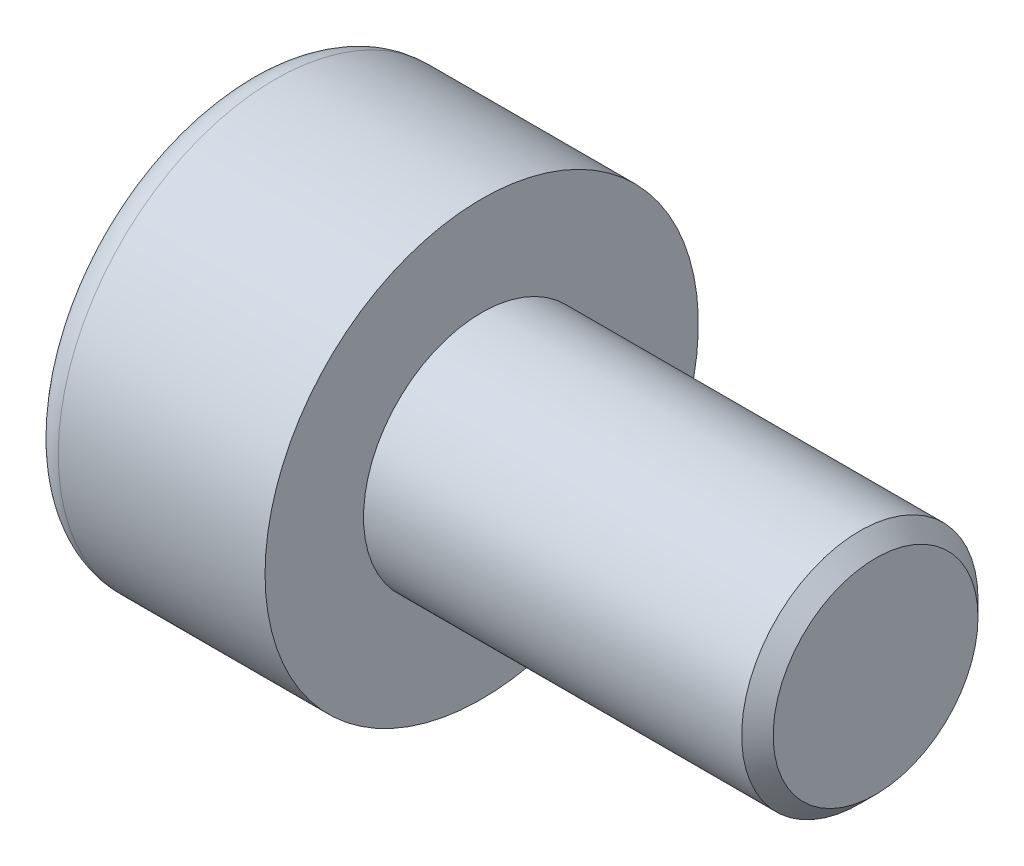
ISO-10303-21;
HEADER;
FILE_DESCRIPTION(('STEP AP214'),'2;1');
FILE_NAME('part.step','',(''),(''),'','','');
FILE_SCHEMA(('AUTOMOTIVE_DESIGN { 1 0 10303 214 1 1 1 1 }'));
ENDSEC;
DATA;
#1=APPLICATION_CONTEXT('core data for automotive mechanical design processes');
#2=APPLICATION_PROTOCOL_DEFINITION('international standard','automotive_design',2000,#1);
#3=PRODUCT_CONTEXT('',#1,'mechanical');
#4=PRODUCT('Part','Part','',(#3));
#5=PRODUCT_RELATED_PRODUCT_CATEGORY('part','',(#4));
#6=PRODUCT_DEFINITION_FORMATION('','',#4);
#7=PRODUCT_DEFINITION_CONTEXT('part definition',#1,'design');
#8=PRODUCT_DEFINITION('design','',#6,#7);
#9=PRODUCT_DEFINITION_SHAPE('','',#8);
#10=(LENGTH_UNIT() NAMED_UNIT(*) SI_UNIT(.MILLI.,.METRE.));
#11=(NAMED_UNIT(*) PLANE_ANGLE_UNIT() SI_UNIT($,.RADIAN.));
#12=(NAMED_UNIT(*) SI_UNIT($,.STERADIAN.) SOLID_ANGLE_UNIT());
#13=UNCERTAINTY_MEASURE_WITH_UNIT(LENGTH_MEASURE(1.E-05),#10,'distance_accuracy_value','');
#14=(GEOMETRIC_REPRESENTATION_CONTEXT(3) GLOBAL_UNCERTAINTY_ASSIGNED_CONTEXT((#13)) GLOBAL_UNIT_ASSIGNED_CONTEXT((#10,
#11,#12)) REPRESENTATION_CONTEXT('',''));
#15=CARTESIAN_POINT('',(0.,0.,0.));
#16=DIRECTION('',(0.,0.,1.));
#17=DIRECTION('',(1.,0.,0.));
#18=AXIS2_PLACEMENT_3D('',#15,#16,#17);
#19=CARTESIAN_POINT('',(1.30000000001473,0.,0.));
#20=DIRECTION('',(-1.,0.,0.));
#21=DIRECTION('',(0.,0.,1.));
#22=AXIS2_PLACEMENT_3D('',#19,#20,#21);
#23=CONICAL_SURFACE('',#22,1.24999999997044,1.04719755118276);
#24=CARTESIAN_POINT('',(2.02168783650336,0.,-5.6843418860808E-11));
#25=VERTEX_POINT('',#24);
#26=VERTEX_LOOP('',#25);
#27=FACE_BOUND('',#26,.T.);
#28=CARTESIAN_POINT('',(1.30000000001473,0.,0.));
#29=DIRECTION('',(-1.,0.,0.));
#30=DIRECTION('',(0.,0.,1.));
#31=AXIS2_PLACEMENT_3D('',#28,#29,#30);
#32=CIRCLE('',#31,1.24999999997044);
#33=CARTESIAN_POINT('',(1.30000000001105,1.24999999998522,0.));
#34=VERTEX_POINT('',#33);
#35=CARTESIAN_POINT('',(1.30000000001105,0.624999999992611,-1.08253175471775));
#36=VERTEX_POINT('',#35);
#37=EDGE_CURVE('E102',#34,#36,#32,.T.);
#38=ORIENTED_EDGE('',*,*,#37,.T.);
#39=CARTESIAN_POINT('',(1.30000000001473,0.,0.));
#40=DIRECTION('',(-1.,0.,0.));
#41=DIRECTION('',(0.,0.,1.));
#42=AXIS2_PLACEMENT_3D('',#39,#40,#41);
#43=CIRCLE('',#42,1.24999999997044);
#44=CARTESIAN_POINT('',(1.30000000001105,-0.62499999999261,-1.08253175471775));
#45=VERTEX_POINT('',#44);
#46=EDGE_CURVE('E105',#36,#45,#43,.T.);
#47=ORIENTED_EDGE('',*,*,#46,.T.);
#48=CARTESIAN_POINT('',(1.30000000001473,0.,0.));
#49=DIRECTION('',(-1.,0.,0.));
#50=DIRECTION('',(0.,0.,1.));
#51=AXIS2_PLACEMENT_3D('',#48,#49,#50);
#52=CIRCLE('',#51,1.24999999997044);
#53=CARTESIAN_POINT('',(1.30000000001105,-1.24999999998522,0.));
#54=VERTEX_POINT('',#53);
#55=EDGE_CURVE('E79',#45,#54,#52,.T.);
#56=ORIENTED_EDGE('',*,*,#55,.T.);
#57=CARTESIAN_POINT('',(1.30000000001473,0.,0.));
#58=DIRECTION('',(-1.,0.,0.));
#59=DIRECTION('',(0.,0.,1.));
#60=AXIS2_PLACEMENT_3D('',#57,#58,#59);
#61=CIRCLE('',#60,1.24999999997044);
#62=CARTESIAN_POINT('',(1.30000000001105,-0.624999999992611,1.08253175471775));
#63=VERTEX_POINT('',#62);
#64=EDGE_CURVE('E306',#54,#63,#61,.T.);
#65=ORIENTED_EDGE('',*,*,#64,.T.);
#66=CARTESIAN_POINT('',(1.30000000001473,0.,0.));
#67=DIRECTION('',(-1.,0.,0.));
#68=DIRECTION('',(0.,0.,1.));
#69=AXIS2_PLACEMENT_3D('',#66,#67,#68);
#70=CIRCLE('',#69,1.24999999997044);
#71=CARTESIAN_POINT('',(1.30000000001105,0.62499999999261,1.08253175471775));
#72=VERTEX_POINT('',#71);
#73=EDGE_CURVE('E308',#63,#72,#70,.T.);
#74=ORIENTED_EDGE('',*,*,#73,.T.);
#75=CARTESIAN_POINT('',(1.30000000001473,0.,0.));
#76=DIRECTION('',(-1.,0.,0.));
#77=DIRECTION('',(0.,0.,1.));
#78=AXIS2_PLACEMENT_3D('',#75,#76,#77);
#79=CIRCLE('',#78,1.24999999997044);
#80=EDGE_CURVE('E108',#72,#34,#79,.T.);
#81=ORIENTED_EDGE('',*,*,#80,.T.);
#82=EDGE_LOOP('',(#38,#47,#56,#65,#74,#81));
#83=FACE_BOUND('',#82,.T.);
#84=ADVANCED_FACE('F36',(#27,#83),#23,.F.);
#85=CARTESIAN_POINT('',(1.3,0.,-1.44337567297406));
#86=DIRECTION('',(1.,0.,0.));
#87=DIRECTION('',(0.,0.,-1.));
#88=AXIS2_PLACEMENT_3D('',#85,#86,#87);
#89=PLANE('',#88);
#90=DIRECTION('',(0.,0.,1.));
#91=VECTOR('',#90,1.);
#92=CARTESIAN_POINT('',(1.30000000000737,-1.25,0.721687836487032));
#93=LINE('',#92,#91);
#94=CARTESIAN_POINT('',(1.30000000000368,-1.24999999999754,-0.721687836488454));
#95=VERTEX_POINT('',#94);
#96=EDGE_CURVE('E208',#54,#95,#93,.F.);
#97=ORIENTED_EDGE('',*,*,#96,.F.);
#98=ORIENTED_EDGE('',*,*,#55,.F.);
#99=DIRECTION('',(0.,-0.866025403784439,0.5));
#100=VECTOR('',#99,1.);
#101=CARTESIAN_POINT('',(1.3,-1.25,-0.721687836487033));
#102=LINE('',#101,#100);
#103=EDGE_CURVE('E85',#95,#45,#102,.F.);
#104=ORIENTED_EDGE('',*,*,#103,.F.);
#105=EDGE_LOOP('',(#97,#98,#104));
#106=FACE_BOUND('',#105,.T.);
#107=ADVANCED_FACE('F97',(#106),#89,.F.);
#108=CARTESIAN_POINT('',(1.3,0.,-1.44337567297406));
#109=DIRECTION('',(1.,0.,0.));
#110=DIRECTION('',(0.,0.,-1.));
#111=AXIS2_PLACEMENT_3D('',#108,#109,#110);
#112=PLANE('',#111);
#113=DIRECTION('',(0.,0.866025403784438,0.5));
#114=VECTOR('',#113,1.);
#115=CARTESIAN_POINT('',(1.30000000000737,0.,1.44337567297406));
#116=LINE('',#115,#114);
#117=CARTESIAN_POINT('',(1.30000000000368,-1.25,0.721687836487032));
#118=VERTEX_POINT('',#117);
#119=EDGE_CURVE('E193',#63,#118,#116,.F.);
#120=ORIENTED_EDGE('',*,*,#119,.F.);
#121=ORIENTED_EDGE('',*,*,#64,.F.);
#122=DIRECTION('',(0.,0.,1.));
#123=VECTOR('',#122,1.);
#124=CARTESIAN_POINT('',(1.3,-1.25,0.721687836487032));
#125=LINE('',#124,#123);
#126=EDGE_CURVE('E196',#118,#54,#125,.F.);
#127=ORIENTED_EDGE('',*,*,#126,.F.);
#128=EDGE_LOOP('',(#120,#121,#127));
#129=FACE_BOUND('',#128,.T.);
#130=ADVANCED_FACE('F296',(#129),#112,.F.);
#131=CARTESIAN_POINT('',(1.3,0.,-1.44337567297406));
#132=DIRECTION('',(1.,0.,0.));
#133=DIRECTION('',(0.,0.,-1.));
#134=AXIS2_PLACEMENT_3D('',#131,#132,#133);
#135=PLANE('',#134);
#136=DIRECTION('',(0.,0.866025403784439,-0.5));
#137=VECTOR('',#136,1.);
#138=CARTESIAN_POINT('',(1.30000000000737,1.25,0.721687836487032));
#139=LINE('',#138,#137);
#140=CARTESIAN_POINT('',(1.30000000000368,0.,1.44337567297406));
#141=VERTEX_POINT('',#140);
#142=EDGE_CURVE('E178',#72,#141,#139,.F.);
#143=ORIENTED_EDGE('',*,*,#142,.F.);
#144=ORIENTED_EDGE('',*,*,#73,.F.);
#145=DIRECTION('',(0.,0.866025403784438,0.5));
#146=VECTOR('',#145,1.);
#147=CARTESIAN_POINT('',(1.3,0.,1.44337567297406));
#148=LINE('',#147,#146);
#149=EDGE_CURVE('E181',#141,#63,#148,.F.);
#150=ORIENTED_EDGE('',*,*,#149,.F.);
#151=EDGE_LOOP('',(#143,#144,#150));
#152=FACE_BOUND('',#151,.T.);
#153=ADVANCED_FACE('F292',(#152),#135,.F.);
#154=CARTESIAN_POINT('',(1.3,0.,-1.44337567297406));
#155=DIRECTION('',(1.,0.,0.));
#156=DIRECTION('',(0.,0.,-1.));
#157=AXIS2_PLACEMENT_3D('',#154,#155,#156);
#158=PLANE('',#157);
#159=DIRECTION('',(0.,0.,-1.));
#160=VECTOR('',#159,1.);
#161=CARTESIAN_POINT('',(1.30000000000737,1.25,-0.721687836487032));
#162=LINE('',#161,#160);
#163=CARTESIAN_POINT('',(1.30000000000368,1.24999999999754,0.721687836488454));
#164=VERTEX_POINT('',#163);
#165=EDGE_CURVE('E163',#34,#164,#162,.F.);
#166=ORIENTED_EDGE('',*,*,#165,.F.);
#167=ORIENTED_EDGE('',*,*,#80,.F.);
#168=DIRECTION('',(0.,0.866025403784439,-0.5));
#169=VECTOR('',#168,1.);
#170=CARTESIAN_POINT('',(1.3,1.25,0.721687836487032));
#171=LINE('',#170,#169);
#172=EDGE_CURVE('E166',#164,#72,#171,.F.);
#173=ORIENTED_EDGE('',*,*,#172,.F.);
#174=EDGE_LOOP('',(#166,#167,#173));
#175=FACE_BOUND('',#174,.T.);
#176=ADVANCED_FACE('F289',(#175),#158,.F.);
#177=CARTESIAN_POINT('',(1.3,0.,-1.44337567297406));
#178=DIRECTION('',(1.,0.,0.));
#179=DIRECTION('',(0.,0.,-1.));
#180=AXIS2_PLACEMENT_3D('',#177,#178,#179);
#181=PLANE('',#180);
#182=DIRECTION('',(0.,-0.866025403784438,-0.5));
#183=VECTOR('',#182,1.);
#184=CARTESIAN_POINT('',(1.30000000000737,0.,-1.44337567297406));
#185=LINE('',#184,#183);
#186=CARTESIAN_POINT('',(1.30000000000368,1.25,-0.721687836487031));
#187=VERTEX_POINT('',#186);
#188=EDGE_CURVE('E115',#36,#187,#185,.F.);
#189=ORIENTED_EDGE('',*,*,#188,.F.);
#190=ORIENTED_EDGE('',*,*,#37,.F.);
#191=DIRECTION('',(0.,0.,-1.));
#192=VECTOR('',#191,1.);
#193=CARTESIAN_POINT('',(1.3,1.25,-0.721687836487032));
#194=LINE('',#193,#192);
#195=EDGE_CURVE('E118',#187,#34,#194,.F.);
#196=ORIENTED_EDGE('',*,*,#195,.F.);
#197=EDGE_LOOP('',(#189,#190,#196));
#198=FACE_BOUND('',#197,.T.);
#199=ADVANCED_FACE('F117',(#198),#181,.F.);
#200=CARTESIAN_POINT('',(1.3,0.,-1.44337567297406));
#201=DIRECTION('',(1.,0.,0.));
#202=DIRECTION('',(0.,0.,-1.));
#203=AXIS2_PLACEMENT_3D('',#200,#201,#202);
#204=PLANE('',#203);
#205=DIRECTION('',(0.,-0.866025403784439,0.5));
#206=VECTOR('',#205,1.);
#207=CARTESIAN_POINT('',(1.30000000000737,-1.25,-0.721687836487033));
#208=LINE('',#207,#206);
#209=CARTESIAN_POINT('',(1.30000000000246,0.,-1.44337567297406));
#210=VERTEX_POINT('',#209);
#211=EDGE_CURVE('E145',#45,#210,#208,.F.);
#212=ORIENTED_EDGE('',*,*,#211,.F.);
#213=ORIENTED_EDGE('',*,*,#46,.F.);
#214=DIRECTION('',(0.,-0.866025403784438,-0.5));
#215=VECTOR('',#214,1.);
#216=CARTESIAN_POINT('',(1.3,0.,-1.44337567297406));
#217=LINE('',#216,#215);
#218=EDGE_CURVE('E126',#210,#36,#217,.F.);
#219=ORIENTED_EDGE('',*,*,#218,.F.);
#220=EDGE_LOOP('',(#212,#213,#219));
#221=FACE_BOUND('',#220,.T.);
#222=ADVANCED_FACE('F283',(#221),#204,.F.);
#223=CARTESIAN_POINT('',(1.3,-1.25,-0.721687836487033));
#224=DIRECTION('',(0.,0.5,0.866025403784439));
#225=DIRECTION('',(0.,-0.866025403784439,0.5));
#226=AXIS2_PLACEMENT_3D('',#223,#224,#225);
#227=PLANE('',#226);
#228=DIRECTION('',(1.,0.,0.));
#229=VECTOR('',#228,1.);
#230=CARTESIAN_POINT('',(1.3,-1.25,-0.721687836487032));
#231=LINE('',#230,#229);
#232=CARTESIAN_POINT('',(0.,-1.25,-0.721687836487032));
#233=VERTEX_POINT('',#232);
#234=EDGE_CURVE('E205',#95,#233,#231,.F.);
#235=ORIENTED_EDGE('',*,*,#234,.F.);
#236=ORIENTED_EDGE('',*,*,#103,.T.);
#237=ORIENTED_EDGE('',*,*,#211,.T.);
#238=DIRECTION('',(1.,0.,0.));
#239=VECTOR('',#238,1.);
#240=CARTESIAN_POINT('',(1.3,0.,-1.44337567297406));
#241=LINE('',#240,#239);
#242=CARTESIAN_POINT('',(0.,0.,-1.44337567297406));
#243=VERTEX_POINT('',#242);
#244=EDGE_CURVE('E130',#243,#210,#241,.T.);
#245=ORIENTED_EDGE('',*,*,#244,.F.);
#246=DIRECTION('',(0.,-0.866025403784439,0.5));
#247=VECTOR('',#246,1.);
#248=CARTESIAN_POINT('',(0.,0.,-1.44337567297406));
#249=LINE('',#248,#247);
#250=EDGE_CURVE('E132',#243,#233,#249,.T.);
#251=ORIENTED_EDGE('',*,*,#250,.T.);
#252=EDGE_LOOP('',(#235,#236,#237,#245,#251));
#253=FACE_BOUND('',#252,.T.);
#254=ADVANCED_FACE('F279',(#253),#227,.T.);
#255=CARTESIAN_POINT('',(1.3,-1.25,0.721687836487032));
#256=DIRECTION('',(0.,1.,0.));
#257=DIRECTION('',(0.,0.,1.));
#258=AXIS2_PLACEMENT_3D('',#255,#256,#257);
#259=PLANE('',#258);
#260=DIRECTION('',(1.,0.,0.));
#261=VECTOR('',#260,1.);
#262=CARTESIAN_POINT('',(1.3,-1.25,0.721687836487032));
#263=LINE('',#262,#261);
#264=CARTESIAN_POINT('',(0.,-1.25,0.721687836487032));
#265=VERTEX_POINT('',#264);
#266=EDGE_CURVE('E190',#118,#265,#263,.F.);
#267=ORIENTED_EDGE('',*,*,#266,.F.);
#268=ORIENTED_EDGE('',*,*,#126,.T.);
#269=ORIENTED_EDGE('',*,*,#96,.T.);
#270=ORIENTED_EDGE('',*,*,#234,.T.);
#271=DIRECTION('',(0.,0.,-1.));
#272=VECTOR('',#271,1.);
#273=CARTESIAN_POINT('',(0.,-1.25,0.));
#274=LINE('',#273,#272);
#275=EDGE_CURVE('E135',#233,#265,#274,.F.);
#276=ORIENTED_EDGE('',*,*,#275,.T.);
#277=EDGE_LOOP('',(#267,#268,#269,#270,#276));
#278=FACE_BOUND('',#277,.T.);
#279=ADVANCED_FACE('F275',(#278),#259,.T.);
#280=CARTESIAN_POINT('',(1.3,0.,1.44337567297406));
#281=DIRECTION('',(0.,0.5,-0.866025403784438));
#282=DIRECTION('',(0.,0.866025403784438,0.5));
#283=AXIS2_PLACEMENT_3D('',#280,#281,#282);
#284=PLANE('',#283);
#285=DIRECTION('',(1.,0.,0.));
#286=VECTOR('',#285,1.);
#287=CARTESIAN_POINT('',(1.3,0.,1.44337567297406));
#288=LINE('',#287,#286);
#289=CARTESIAN_POINT('',(0.,0.,1.44337567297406));
#290=VERTEX_POINT('',#289);
#291=EDGE_CURVE('E175',#141,#290,#288,.F.);
#292=ORIENTED_EDGE('',*,*,#291,.F.);
#293=ORIENTED_EDGE('',*,*,#149,.T.);
#294=ORIENTED_EDGE('',*,*,#119,.T.);
#295=ORIENTED_EDGE('',*,*,#266,.T.);
#296=DIRECTION('',(0.,0.866025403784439,0.5));
#297=VECTOR('',#296,1.);
#298=CARTESIAN_POINT('',(0.,-1.25,0.721687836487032));
#299=LINE('',#298,#297);
#300=EDGE_CURVE('E357',#265,#290,#299,.T.);
#301=ORIENTED_EDGE('',*,*,#300,.T.);
#302=EDGE_LOOP('',(#292,#293,#294,#295,#301));
#303=FACE_BOUND('',#302,.T.);
#304=ADVANCED_FACE('F271',(#303),#284,.T.);
#305=CARTESIAN_POINT('',(1.3,1.25,0.721687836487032));
#306=DIRECTION('',(0.,-0.5,-0.866025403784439));
#307=DIRECTION('',(0.,0.866025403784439,-0.5));
#308=AXIS2_PLACEMENT_3D('',#305,#306,#307);
#309=PLANE('',#308);
#310=DIRECTION('',(1.,0.,0.));
#311=VECTOR('',#310,1.);
#312=CARTESIAN_POINT('',(1.3,1.25,0.721687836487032));
#313=LINE('',#312,#311);
#314=CARTESIAN_POINT('',(0.,1.25,0.721687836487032));
#315=VERTEX_POINT('',#314);
#316=EDGE_CURVE('E160',#164,#315,#313,.F.);
#317=ORIENTED_EDGE('',*,*,#316,.F.);
#318=ORIENTED_EDGE('',*,*,#172,.T.);
#319=ORIENTED_EDGE('',*,*,#142,.T.);
#320=ORIENTED_EDGE('',*,*,#291,.T.);
#321=DIRECTION('',(0.,0.866025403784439,-0.5));
#322=VECTOR('',#321,1.);
#323=CARTESIAN_POINT('',(0.,0.,1.44337567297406));
#324=LINE('',#323,#322);
#325=EDGE_CURVE('E337',#290,#315,#324,.T.);
#326=ORIENTED_EDGE('',*,*,#325,.T.);
#327=EDGE_LOOP('',(#317,#318,#319,#320,#326));
#328=FACE_BOUND('',#327,.T.);
#329=ADVANCED_FACE('F267',(#328),#309,.T.);
#330=CARTESIAN_POINT('',(1.3,1.25,-0.721687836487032));
#331=DIRECTION('',(0.,-1.,0.));
#332=DIRECTION('',(0.,0.,-1.));
#333=AXIS2_PLACEMENT_3D('',#330,#331,#332);
#334=PLANE('',#333);
#335=DIRECTION('',(1.,0.,0.));
#336=VECTOR('',#335,1.);
#337=CARTESIAN_POINT('',(1.3,1.25,-0.721687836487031));
#338=LINE('',#337,#336);
#339=CARTESIAN_POINT('',(0.,1.25,-0.721687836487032));
#340=VERTEX_POINT('',#339);
#341=EDGE_CURVE('E122',#187,#340,#338,.F.);
#342=ORIENTED_EDGE('',*,*,#341,.F.);
#343=ORIENTED_EDGE('',*,*,#195,.T.);
#344=ORIENTED_EDGE('',*,*,#165,.T.);
#345=ORIENTED_EDGE('',*,*,#316,.T.);
#346=DIRECTION('',(0.,0.,-1.));
#347=VECTOR('',#346,1.);
#348=CARTESIAN_POINT('',(0.,1.25,0.));
#349=LINE('',#348,#347);
#350=EDGE_CURVE('E151',#315,#340,#349,.T.);
#351=ORIENTED_EDGE('',*,*,#350,.T.);
#352=EDGE_LOOP('',(#342,#343,#344,#345,#351));
#353=FACE_BOUND('',#352,.T.);
#354=ADVANCED_FACE('F264',(#353),#334,.T.);
#355=CARTESIAN_POINT('',(1.3,0.,-1.44337567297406));
#356=DIRECTION('',(0.,-0.5,0.866025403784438));
#357=DIRECTION('',(0.,-0.866025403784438,-0.5));
#358=AXIS2_PLACEMENT_3D('',#355,#356,#357);
#359=PLANE('',#358);
#360=ORIENTED_EDGE('',*,*,#244,.T.);
#361=ORIENTED_EDGE('',*,*,#218,.T.);
#362=ORIENTED_EDGE('',*,*,#188,.T.);
#363=ORIENTED_EDGE('',*,*,#341,.T.);
#364=DIRECTION('',(0.,-0.866025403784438,-0.5));
#365=VECTOR('',#364,1.);
#366=CARTESIAN_POINT('',(0.,1.25,-0.721687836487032));
#367=LINE('',#366,#365);
#368=EDGE_CURVE('E149',#340,#243,#367,.T.);
#369=ORIENTED_EDGE('',*,*,#368,.T.);
#370=EDGE_LOOP('',(#360,#361,#362,#363,#369));
#371=FACE_BOUND('',#370,.T.);
#372=ADVANCED_FACE('F127',(#371),#359,.T.);
#373=CARTESIAN_POINT('',(0.,0.,0.));
#374=DIRECTION('',(1.,0.,0.));
#375=DIRECTION('',(0.,0.,-1.));
#376=AXIS2_PLACEMENT_3D('',#373,#374,#375);
#377=PLANE('',#376);
#378=CARTESIAN_POINT('',(0.,0.,2.375));
#379=CARTESIAN_POINT('',(4.78194973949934E-11,-0.030881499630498,2.3749864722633));
#380=CARTESIAN_POINT('',(7.69535364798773E-10,-0.0617627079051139,2.37437165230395));
#381=CARTESIAN_POINT('',(2.79618100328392E-09,-0.123477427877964,2.37194179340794));
#382=CARTESIAN_POINT('',(4.1011023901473E-09,-0.154310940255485,2.37012677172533));
#383=CARTESIAN_POINT('',(6.5296133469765E-09,-0.215883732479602,2.36529889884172));
#384=CARTESIAN_POINT('',(7.6532047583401E-09,-0.246623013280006,2.36228605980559));
#385=CARTESIAN_POINT('',(9.29233137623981E-09,-0.307960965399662,2.35506722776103));
#386=CARTESIAN_POINT('',(9.80787019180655E-09,-0.338559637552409,2.3508612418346));
#387=CARTESIAN_POINT('',(1.00513073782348E-08,-0.399570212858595,2.34126244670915));
#388=CARTESIAN_POINT('',(9.7792071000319E-09,-0.429982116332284,2.33586963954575));
#389=CARTESIAN_POINT('',(8.53989626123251E-09,-0.490573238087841,2.3239053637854));
#390=CARTESIAN_POINT('',(7.57268395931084E-09,-0.520752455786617,2.3173338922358));
#391=CARTESIAN_POINT('',(5.29855553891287E-09,-0.580832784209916,2.30302215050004));
#392=CARTESIAN_POINT('',(3.9916371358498E-09,-0.610733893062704,2.29528187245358));
#393=CARTESIAN_POINT('',(1.66833738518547E-09,-0.67021245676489,2.27864435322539));
#394=CARTESIAN_POINT('',(6.51959217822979E-10,-0.699789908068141,2.269747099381));
#395=CARTESIAN_POINT('',(-3.11361894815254E-10,-0.764456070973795,2.24891480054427));
#396=CARTESIAN_POINT('',(-3.78171250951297E-12,-0.799464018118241,2.23672808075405));
#397=CARTESIAN_POINT('',(4.3997585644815E-09,-0.868873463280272,2.21073428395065));
#398=CARTESIAN_POINT('',(8.49581062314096E-09,-0.903274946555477,2.19692716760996));
#399=CARTESIAN_POINT('',(2.27624639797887E-08,-0.971397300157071,2.16772185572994));
#400=CARTESIAN_POINT('',(3.2933249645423E-08,-1.00511814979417,2.15232361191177));
#401=CARTESIAN_POINT('',(6.36645579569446E-08,-1.07180588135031,2.11997119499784));
#402=CARTESIAN_POINT('',(8.42254590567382E-08,-1.10477273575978,2.10301696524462));
#403=CARTESIAN_POINT('',(1.39270773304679E-07,-1.17523693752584,2.06466753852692));
#404=CARTESIAN_POINT('',(1.75489863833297E-07,-1.21258689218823,2.04300069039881));
#405=CARTESIAN_POINT('',(2.48905653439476E-07,-1.28440552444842,1.99867135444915));
#406=CARTESIAN_POINT('',(2.85986469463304E-07,-1.31892838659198,1.97609653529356));
#407=CARTESIAN_POINT('',(3.57137128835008E-07,-1.38516343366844,1.93027299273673));
#408=CARTESIAN_POINT('',(3.91266689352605E-07,-1.41693156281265,1.90710513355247));
#409=CARTESIAN_POINT('',(4.51975950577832E-07,-1.47774486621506,1.86039239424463));
#410=CARTESIAN_POINT('',(4.78843918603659E-07,-1.50684716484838,1.83692178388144));
#411=CARTESIAN_POINT('',(5.27193609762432E-07,-1.56896991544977,1.78434385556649));
#412=CARTESIAN_POINT('',(5.46874705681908E-07,-1.60176976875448,1.75497514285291));
#413=CARTESIAN_POINT('',(5.66348855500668E-07,-1.66348945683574,1.69652728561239));
#414=CARTESIAN_POINT('',(5.6741186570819E-07,-1.69252116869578,1.66756610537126));
#415=CARTESIAN_POINT('',(5.49278764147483E-07,-1.74695929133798,1.61035703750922));
#416=CARTESIAN_POINT('',(5.31567019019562E-07,-1.77247529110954,1.58221336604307));
#417=CARTESIAN_POINT('',(4.7865576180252E-07,-1.82014789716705,1.52700898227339));
#418=CARTESIAN_POINT('',(4.44956594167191E-07,-1.84241037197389,1.50003973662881));
#419=CARTESIAN_POINT('',(3.80192576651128E-07,-1.87615341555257,1.45725509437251));
#420=CARTESIAN_POINT('',(3.54530224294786E-07,-1.88805578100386,1.44177070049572));
#421=CARTESIAN_POINT('',(3.01672338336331E-07,-1.91082030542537,1.41137979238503));
#422=CARTESIAN_POINT('',(2.74641412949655E-07,-1.92170350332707,1.39648902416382));
#423=CARTESIAN_POINT('',(1.92568730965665E-07,-1.95192682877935,1.35408770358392));
#424=CARTESIAN_POINT('',(1.32786884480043E-07,-1.9708532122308,1.32627989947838));
#425=CARTESIAN_POINT('',(7.10177754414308E-08,-1.99792056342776,1.28464033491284));
#426=CARTESIAN_POINT('',(5.51563949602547E-08,-2.00652466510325,1.27110655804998));
#427=CARTESIAN_POINT('',(2.94404571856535E-08,-2.02558865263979,1.24045947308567));
#428=CARTESIAN_POINT('',(2.20877306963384E-08,-2.03597318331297,1.22329915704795));
#429=CARTESIAN_POINT('',(8.21894927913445E-09,-2.06171558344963,1.17952944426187));
#430=CARTESIAN_POINT('',(4.22694594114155E-09,-2.0767816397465,1.1527478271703));
#431=CARTESIAN_POINT('',(-4.66657100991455E-10,-2.10884316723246,1.0930928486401));
#432=CARTESIAN_POINT('',(-3.29020491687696E-10,-2.12560365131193,1.06009314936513));
#433=CARTESIAN_POINT('',(1.09906817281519E-09,-2.16028363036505,0.987683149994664));
#434=CARTESIAN_POINT('',(2.58116684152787E-09,-2.17791723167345,0.948135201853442));
#435=CARTESIAN_POINT('',(4.72947550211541E-09,-2.20362959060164,0.885964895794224));
#436=CARTESIAN_POINT('',(5.46499034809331E-09,-2.21246502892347,0.863652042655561));
#437=CARTESIAN_POINT('',(6.80287604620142E-09,-2.23001322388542,0.817300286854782));
#438=CARTESIAN_POINT('',(7.39338798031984E-09,-2.23868013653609,0.79324396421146));
#439=CARTESIAN_POINT('',(8.34578603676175E-09,-2.25574221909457,0.743379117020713));
#440=CARTESIAN_POINT('',(8.69140640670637E-09,-2.26408802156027,0.71755370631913));
#441=CARTESIAN_POINT('',(9.10284893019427E-09,-2.28034812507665,0.664130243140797));
#442=CARTESIAN_POINT('',(9.15132671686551E-09,-2.28820952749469,0.636516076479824));
#443=CARTESIAN_POINT('',(8.95963656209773E-09,-2.30332976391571,0.579503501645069));
#444=CARTESIAN_POINT('',(8.70353730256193E-09,-2.3105321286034,0.550090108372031));
#445=CARTESIAN_POINT('',(7.937539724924E-09,-2.32415237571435,0.489477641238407));
#446=CARTESIAN_POINT('',(7.41516909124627E-09,-2.33051021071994,0.458265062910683));
#447=CARTESIAN_POINT('',(6.19536040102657E-09,-2.3422489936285,0.394064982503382));
#448=CARTESIAN_POINT('',(5.49056107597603E-09,-2.34756632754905,0.361065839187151));
#449=CARTESIAN_POINT('',(4.02892355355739E-09,-2.35702185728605,0.293317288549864));
#450=CARTESIAN_POINT('',(3.27119622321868E-09,-2.36109291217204,0.258558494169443));
#451=CARTESIAN_POINT('',(1.87122167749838E-09,-2.36784457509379,0.187332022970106));
#452=CARTESIAN_POINT('',(1.23568310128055E-09,-2.37045458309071,0.150857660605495));
#453=CARTESIAN_POINT('',(2.92491071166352E-10,-2.37406504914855,0.0762570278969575));
#454=CARTESIAN_POINT('',(0.,-2.37499155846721,0.0381270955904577));
#455=CARTESIAN_POINT('',(0.,-2.37500430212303,-0.0194310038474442));
#456=CARTESIAN_POINT('',(7.58249117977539E-11,-2.37477015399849,-0.0388612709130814));
#457=CARTESIAN_POINT('',(3.65216400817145E-10,-2.37382494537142,-0.0777102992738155));
#458=CARTESIAN_POINT('',(5.78735992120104E-10,-2.37311388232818,-0.0971290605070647));
#459=CARTESIAN_POINT('',(1.40539323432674E-09,-2.37026583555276,-0.155350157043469));
#460=CARTESIAN_POINT('',(2.2046330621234E-09,-2.36741399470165,-0.19411993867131));
#461=CARTESIAN_POINT('',(4.19596621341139E-09,-2.35981093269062,-0.271471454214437));
#462=CARTESIAN_POINT('',(5.38806331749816E-09,-2.35505969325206,-0.310053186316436));
#463=CARTESIAN_POINT('',(8.06918854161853E-09,-2.34366921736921,-0.386937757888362));
#464=CARTESIAN_POINT('',(9.55821931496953E-09,-2.33702996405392,-0.425240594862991));
#465=CARTESIAN_POINT('',(1.27442930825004E-08,-2.32187944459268,-0.501474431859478));
#466=CARTESIAN_POINT('',(1.44413377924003E-08,-2.3133681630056,-0.539405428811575));
#467=CARTESIAN_POINT('',(1.79616609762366E-08,-2.29449407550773,-0.614804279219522));
#468=CARTESIAN_POINT('',(1.97849404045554E-08,-2.28413125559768,-0.652272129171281));
#469=CARTESIAN_POINT('',(2.34830586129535E-08,-2.26157905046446,-0.726654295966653));
#470=CARTESIAN_POINT('',(2.53578977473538E-08,-2.24938965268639,-0.763568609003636));
#471=CARTESIAN_POINT('',(2.90915745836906E-08,-2.22321365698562,-0.836754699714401));
#472=CARTESIAN_POINT('',(3.09504121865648E-08,-2.20922704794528,-0.873026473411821));
#473=CARTESIAN_POINT('',(3.45916360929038E-08,-2.17949033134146,-0.944840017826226));
#474=CARTESIAN_POINT('',(3.63740219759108E-08,-2.16374021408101,-0.980381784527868));
#475=CARTESIAN_POINT('',(3.98090046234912E-08,-2.13051443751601,-1.05064961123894));
#476=CARTESIAN_POINT('',(4.14616007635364E-08,-2.11303876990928,-1.08537566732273));
#477=CARTESIAN_POINT('',(4.45907775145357E-08,-2.07640401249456,-1.15392833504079));
#478=CARTESIAN_POINT('',(4.60673573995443E-08,-2.05724491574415,-1.187754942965));
#479=CARTESIAN_POINT('',(4.88053870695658E-08,-2.01728948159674,-1.25442714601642));
#480=CARTESIAN_POINT('',(5.00668361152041E-08,-1.9964931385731,-1.28727273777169));
#481=CARTESIAN_POINT('',(5.23426010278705E-08,-1.95331334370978,-1.35190370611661));
#482=CARTESIAN_POINT('',(5.33569162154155E-08,-1.93092988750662,-1.38368907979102));
#483=CARTESIAN_POINT('',(5.51135222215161E-08,-1.88462982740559,-1.44612296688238));
#484=CARTESIAN_POINT('',(5.58558124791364E-08,-1.86071322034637,-1.47677147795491));
#485=CARTESIAN_POINT('',(5.705058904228E-08,-1.81140451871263,-1.53685773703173));
#486=CARTESIAN_POINT('',(5.75030749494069E-08,-1.78601242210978,-1.56629548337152));
#487=CARTESIAN_POINT('',(5.81075750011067E-08,-1.73381396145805,-1.62388923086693));
#488=CARTESIAN_POINT('',(5.82595889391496E-08,-1.70700759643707,-1.65204523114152));
#489=CARTESIAN_POINT('',(5.82595889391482E-08,-1.65204523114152,-1.70700759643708));
#490=CARTESIAN_POINT('',(5.81075750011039E-08,-1.62388923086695,-1.73381396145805));
#491=CARTESIAN_POINT('',(5.75030749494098E-08,-1.5662954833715,-1.78601242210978));
#492=CARTESIAN_POINT('',(5.705058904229E-08,-1.53685773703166,-1.81140451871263));
#493=CARTESIAN_POINT('',(5.58558124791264E-08,-1.47677147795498,-1.86071322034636));
#494=CARTESIAN_POINT('',(5.51135222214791E-08,-1.44612296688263,-1.88462982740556));
#495=CARTESIAN_POINT('',(5.33569162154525E-08,-1.38368907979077,-1.93092988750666));
#496=CARTESIAN_POINT('',(5.23426010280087E-08,-1.35190370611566,-1.95331334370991));
#497=CARTESIAN_POINT('',(5.00668361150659E-08,-1.28727273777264,-1.99649313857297));
#498=CARTESIAN_POINT('',(4.88053870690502E-08,-1.25442714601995,-2.01728948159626));
#499=CARTESIAN_POINT('',(4.60673574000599E-08,-1.18775494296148,-2.05724491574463));
#500=CARTESIAN_POINT('',(4.459077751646E-08,-1.15392833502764,-2.07640401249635));
#501=CARTESIAN_POINT('',(4.14616007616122E-08,-1.08537566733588,-2.11303876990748));
#502=CARTESIAN_POINT('',(3.98090046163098E-08,-1.050649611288,-2.13051443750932));
#503=CARTESIAN_POINT('',(3.63740219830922E-08,-0.980381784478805,-2.1637402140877));
#504=CARTESIAN_POINT('',(3.45916361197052E-08,-0.944840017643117,-2.17949033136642));
#505=CARTESIAN_POINT('',(3.09504121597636E-08,-0.873026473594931,-2.20922704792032));
#506=CARTESIAN_POINT('',(2.90915744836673E-08,-0.836754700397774,-2.22321365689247));
#507=CARTESIAN_POINT('',(2.53578978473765E-08,-0.763568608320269,-2.24938965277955));
#508=CARTESIAN_POINT('',(2.34830589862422E-08,-0.726654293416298,-2.26157905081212));
#509=CARTESIAN_POINT('',(1.97849400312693E-08,-0.652272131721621,-2.28413125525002));
#510=CARTESIAN_POINT('',(1.79616595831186E-08,-0.614804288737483,-2.29449407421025));
#511=CARTESIAN_POINT('',(1.44413391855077E-08,-0.539405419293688,-2.31336816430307));
#512=CARTESIAN_POINT('',(1.27442982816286E-08,-0.50147439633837,-2.3218794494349));
#513=CARTESIAN_POINT('',(9.55821411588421E-09,-0.425240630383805,-2.33702995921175));
#514=CARTESIAN_POINT('',(8.06916913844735E-09,-0.386937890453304,-2.34366919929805));
#515=CARTESIAN_POINT('',(5.38808272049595E-09,-0.31005305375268,-2.35505971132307));
#516=CARTESIAN_POINT('',(4.1960386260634E-09,-0.271470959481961,-2.35981100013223));
#517=CARTESIAN_POINT('',(2.20456065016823E-09,-0.194120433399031,-2.36741392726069));
#518=CARTESIAN_POINT('',(1.40512299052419E-09,-0.155352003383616,-2.37026558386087));
#519=CARTESIAN_POINT('',(3.03484373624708E-10,-0.0777223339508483,-2.37406337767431));
#520=CARTESIAN_POINT('',(1.27828944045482E-12,-0.0388610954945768,-2.3750095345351));
#521=CARTESIAN_POINT('',(0.,0.,-2.375));
#522=B_SPLINE_CURVE_WITH_KNOTS('',3,(#378,#379,#380,#381,#382,#383,#384,#385,#386,#387,#388,
#389,#390,#391,#392,#393,#394,#395,#396,#397,#398,#399,#400,#401,#402,#403,#404,#405,#406,#407,
#408,#409,#410,#411,#412,#413,#414,#415,#416,#417,#418,#419,#420,#421,#422,#423,#424,#425,#426,
#427,#428,#429,#430,#431,#432,#433,#434,#435,#436,#437,#438,#439,#440,#441,#442,#443,#444,#445,
#446,#447,#448,#449,#450,#451,#452,#453,#454,#455,#456,#457,#458,#459,#460,#461,#462,#463,#464,
#465,#466,#467,#468,#469,#470,#471,#472,#473,#474,#475,#476,#477,#478,#479,#480,#481,#482,#483,
#484,#485,#486,#487,#488,#489,#490,#491,#492,#493,#494,#495,#496,#497,#498,#499,#500,#501,#502,
#503,#504,#505,#506,#507,#508,#509,#510,#511,#512,#513,#514,#515,#516,#517,#518,#519,#520,#521),
.UNSPECIFIED.,.F.,.F.,(4,2,2,2,2,2,2,2,2,2,2,2,2,2,2,2,2,2,2,2,2,2,2,2,2,2,2,2,2,2,2,2,2,2,2,2,
2,2,2,2,2,2,2,2,2,2,2,2,2,2,2,2,2,2,2,2,2,2,2,2,2,2,2,2,2,2,2,2,2,2,2,4),(0.,0.0926386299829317,
0.185275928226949,0.277912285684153,0.370548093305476,0.463183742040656,0.555819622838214,
0.648456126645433,0.74109364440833,0.852257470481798,0.963423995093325,1.07459389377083,
1.18576784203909,1.31523988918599,1.43893022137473,1.55683711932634,1.66895902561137,
1.80096799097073,1.92393454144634,2.03785654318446,2.14273227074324,2.20131761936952,
2.25664519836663,2.35752077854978,2.40563033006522,2.46579758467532,2.55795953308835,
2.66895740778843,2.79878936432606,2.87077576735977,2.94747177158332,3.02887739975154,
3.11499269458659,3.20581771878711,3.30135255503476,3.40159730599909,3.50655209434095,
3.61621706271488,3.73059237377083,3.78888233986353,3.84717261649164,3.96374527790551,
4.08031906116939,4.19689388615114,4.31346967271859,4.43004634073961,4.54662381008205,
4.66320200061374,4.77978083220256,4.89636022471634,5.01294009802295,5.12952037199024,
5.24610096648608,5.36268180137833,5.47926279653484,5.5958438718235,5.71242494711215,
5.82900594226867,5.94558677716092,6.06216737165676,6.17874764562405,6.29532751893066,
6.41190691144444,6.52848574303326,6.64506393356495,6.76164140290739,6.87821807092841,
6.99479385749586,7.1113686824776,7.22794246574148,7.34451512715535,7.46108658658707),.UNSPECIFIED.);
#523=CARTESIAN_POINT('',(0.,0.,2.375));
#524=VERTEX_POINT('',#523);
#525=CARTESIAN_POINT('',(0.,-3.87664880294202E-07,-2.37500000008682));
#526=VERTEX_POINT('',#525);
#527=EDGE_CURVE('E52',#524,#526,#522,.T.);
#528=ORIENTED_EDGE('',*,*,#527,.F.);
#529=CARTESIAN_POINT('',(0.,0.,-2.375));
#530=CARTESIAN_POINT('',(4.78999873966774E-11,0.0308814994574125,-2.3749864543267));
#531=CARTESIAN_POINT('',(7.71527470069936E-10,0.0617627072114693,-2.37437161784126));
#532=CARTESIAN_POINT('',(2.80386913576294E-09,0.123477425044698,-2.37194172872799));
#533=CARTESIAN_POINT('',(4.11257489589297E-09,0.154310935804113,-2.37012669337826));
#534=CARTESIAN_POINT('',(6.54873805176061E-09,0.215883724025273,-2.36529879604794));
#535=CARTESIAN_POINT('',(7.67619729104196E-09,0.246623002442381,-2.36228594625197));
#536=CARTESIAN_POINT('',(9.32192207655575E-09,0.307960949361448,-2.35506709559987));
#537=CARTESIAN_POINT('',(9.84019124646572E-09,0.338559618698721,-2.35086110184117));
#538=CARTESIAN_POINT('',(1.00871467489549E-08,0.39957018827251,-2.34126229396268));
#539=CARTESIAN_POINT('',(9.81583444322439E-09,0.429982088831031,-2.33586948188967));
#540=CARTESIAN_POINT('',(8.57580985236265E-09,0.490573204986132,-2.32390519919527));
#541=CARTESIAN_POINT('',(7.60709582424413E-09,0.52075242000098,-2.31733372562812));
#542=CARTESIAN_POINT('',(5.32777082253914E-09,0.580832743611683,-2.30302198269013));
#543=CARTESIAN_POINT('',(4.01715755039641E-09,0.610733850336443,-2.29528170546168));
#544=CARTESIAN_POINT('',(1.6848289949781E-09,0.670212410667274,-2.2786441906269));
#545=CARTESIAN_POINT('',(6.63116874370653E-10,0.699789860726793,-2.26974694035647));
#546=CARTESIAN_POINT('',(-3.12674995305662E-10,0.764456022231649,-2.24891465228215));
#547=CARTESIAN_POINT('',(-1.2378822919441E-11,0.799463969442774,-2.23672794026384));
#548=CARTESIAN_POINT('',(4.37825971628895E-09,0.868873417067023,-2.21073416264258));
#549=CARTESIAN_POINT('',(8.46869412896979E-09,0.903274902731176,-2.19692705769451));
#550=CARTESIAN_POINT('',(2.27290251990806E-08,0.971397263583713,-2.1677217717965));
#551=CARTESIAN_POINT('',(3.28991064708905E-08,1.00511811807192,-2.15232354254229));
#552=CARTESIAN_POINT('',(6.36393144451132E-08,1.0718058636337,-2.11997115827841));
#553=CARTESIAN_POINT('',(8.42098201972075E-08,1.10477272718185,-2.10301694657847));
#554=CARTESIAN_POINT('',(1.39283543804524E-07,1.17522998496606,-2.06467134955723));
#555=CARTESIAN_POINT('',(1.75521160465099E-07,1.21257319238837,-2.04300869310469));
#556=CARTESIAN_POINT('',(2.48977330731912E-07,1.28438002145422,-1.99868768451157));
#557=CARTESIAN_POINT('',(2.86079921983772E-07,1.31889777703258,-1.97611692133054));
#558=CARTESIAN_POINT('',(3.57273899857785E-07,1.38512419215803,-1.9303011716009));
#559=CARTESIAN_POINT('',(3.91424979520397E-07,1.41688874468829,-1.90713697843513));
#560=CARTESIAN_POINT('',(4.52173399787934E-07,1.47769635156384,-1.86043101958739));
#561=CARTESIAN_POINT('',(4.7905901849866E-07,1.50679647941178,-1.83696346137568));
#562=CARTESIAN_POINT('',(5.2744136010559E-07,1.5689161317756,-1.78439128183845));
#563=CARTESIAN_POINT('',(5.47135724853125E-07,1.60171504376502,-1.75502523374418));
#564=CARTESIAN_POINT('',(5.66624012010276E-07,1.66343466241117,-1.69658122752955));
#565=CARTESIAN_POINT('',(5.67687863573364E-07,1.69246715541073,-1.66762114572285));
#566=CARTESIAN_POINT('',(5.49544058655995E-07,1.74690838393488,-1.6104125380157));
#567=CARTESIAN_POINT('',(5.3182057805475E-07,1.77242662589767,-1.58226815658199));
#568=CARTESIAN_POINT('',(4.788758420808E-07,1.82010500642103,-1.52706041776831));
#569=CARTESIAN_POINT('',(4.45154509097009E-07,1.84237094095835,-1.50008846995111));
#570=CARTESIAN_POINT('',(3.8035146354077E-07,1.87611994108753,-1.45729842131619));
#571=CARTESIAN_POINT('',(3.54673249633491E-07,1.8880248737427,-1.44181139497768));
#572=CARTESIAN_POINT('',(3.01783239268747E-07,1.9107948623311,-1.41141444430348));
#573=CARTESIAN_POINT('',(2.74735894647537E-07,1.92168094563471,-1.39652025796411));
#574=CARTESIAN_POINT('',(1.92614755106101E-07,1.9519140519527,-1.35410648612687));
#575=CARTESIAN_POINT('',(1.32802020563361E-07,1.97084702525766,-1.32628941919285));
#576=CARTESIAN_POINT('',(7.10172912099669E-08,1.99792056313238,-1.28464033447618));
#577=CARTESIAN_POINT('',(5.5156250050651E-08,2.00652466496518,-1.27110655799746));
#578=CARTESIAN_POINT('',(2.94406382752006E-08,2.02558865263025,-1.24045947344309));
#579=CARTESIAN_POINT('',(2.20877887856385E-08,2.03597318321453,-1.22329915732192));
#580=CARTESIAN_POINT('',(8.21886015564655E-09,2.06171558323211,-1.17952944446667));
#581=CARTESIAN_POINT('',(4.22691992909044E-09,2.07678163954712,-1.15274782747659));
#582=CARTESIAN_POINT('',(-4.66625774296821E-10,2.10884316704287,-1.09309284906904));
#583=CARTESIAN_POINT('',(-3.29011648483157E-10,2.12560365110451,-1.06009314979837));
#584=CARTESIAN_POINT('',(1.09905782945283E-09,2.16028363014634,-0.987683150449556));
#585=CARTESIAN_POINT('',(2.58116481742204E-09,2.1779172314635,-0.948135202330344));
#586=CARTESIAN_POINT('',(4.72947662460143E-09,2.20362959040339,-0.885964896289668));
#587=CARTESIAN_POINT('',(5.46499065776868E-09,2.21246502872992,-0.863652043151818));
#588=CARTESIAN_POINT('',(6.80287571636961E-09,2.23001322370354,-0.817300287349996));
#589=CARTESIAN_POINT('',(7.39338789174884E-09,2.23868013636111,-0.793243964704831));
#590=CARTESIAN_POINT('',(8.34578613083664E-09,2.2557422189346,-0.743379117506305));
#591=CARTESIAN_POINT('',(8.69140642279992E-09,2.26408802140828,-0.717553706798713));
#592=CARTESIAN_POINT('',(9.10284891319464E-09,2.28034812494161,-0.664130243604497));
#593=CARTESIAN_POINT('',(9.1513267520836E-09,2.2882095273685,-0.636516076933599));
#594=CARTESIAN_POINT('',(8.95963663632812E-09,2.30332976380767,-0.579503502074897));
#595=CARTESIAN_POINT('',(8.70353735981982E-09,2.31053212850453,-0.550090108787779));
#596=CARTESIAN_POINT('',(7.93753977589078E-09,2.32415237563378,-0.489477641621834));
#597=CARTESIAN_POINT('',(7.41516915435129E-09,2.33051021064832,-0.458265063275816));
#598=CARTESIAN_POINT('',(6.1953604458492E-09,2.3422489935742,-0.394064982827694));
#599=CARTESIAN_POINT('',(5.49056108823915E-09,2.3475663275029,-0.36106583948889));
#600=CARTESIAN_POINT('',(4.02892354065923E-09,2.35702185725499,-0.293317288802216));
#601=CARTESIAN_POINT('',(3.27119621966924E-09,2.3610929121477,-0.258558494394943));
#602=CARTESIAN_POINT('',(1.87122168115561E-09,2.36784457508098,-0.187332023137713));
#603=CARTESIAN_POINT('',(1.23568310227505E-09,2.37045458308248,-0.150857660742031));
#604=CARTESIAN_POINT('',(2.92491070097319E-10,2.37406504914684,-0.0762570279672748));
#605=CARTESIAN_POINT('',(0.,2.3749915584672,-0.0381270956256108));
#606=CARTESIAN_POINT('',(0.,2.37500430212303,0.0194310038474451));
#607=CARTESIAN_POINT('',(7.5824911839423E-11,2.37477015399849,0.0388612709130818));
#608=CARTESIAN_POINT('',(3.65216400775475E-10,2.37382494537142,0.0777102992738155));
#609=CARTESIAN_POINT('',(5.78735992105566E-10,2.37311388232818,0.097129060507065));
#610=CARTESIAN_POINT('',(1.40539323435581E-09,2.37026583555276,0.15535015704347));
#611=CARTESIAN_POINT('',(2.20463306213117E-09,2.36741399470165,0.194119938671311));
#612=CARTESIAN_POINT('',(4.1959662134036E-09,2.35981093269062,0.271471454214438));
#613=CARTESIAN_POINT('',(5.38806331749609E-09,2.35505969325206,0.310053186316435));
#614=CARTESIAN_POINT('',(8.06918854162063E-09,2.34366921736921,0.386937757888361));
#615=CARTESIAN_POINT('',(9.55821931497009E-09,2.33702996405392,0.42524059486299));
#616=CARTESIAN_POINT('',(1.27442930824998E-08,2.32187944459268,0.501474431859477));
#617=CARTESIAN_POINT('',(1.44413377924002E-08,2.3133681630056,0.539405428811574));
#618=CARTESIAN_POINT('',(1.79616609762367E-08,2.29449407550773,0.614804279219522));
#619=CARTESIAN_POINT('',(1.97849404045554E-08,2.28413125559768,0.652272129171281));
#620=CARTESIAN_POINT('',(2.34830586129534E-08,2.26157905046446,0.726654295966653));
#621=CARTESIAN_POINT('',(2.53578977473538E-08,2.24938965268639,0.763568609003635));
#622=CARTESIAN_POINT('',(2.90915745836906E-08,2.22321365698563,0.8367546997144));
#623=CARTESIAN_POINT('',(3.09504121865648E-08,2.20922704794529,0.87302647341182));
#624=CARTESIAN_POINT('',(3.45916360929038E-08,2.17949033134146,0.944840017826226));
#625=CARTESIAN_POINT('',(3.63740219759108E-08,2.16374021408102,0.980381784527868));
#626=CARTESIAN_POINT('',(3.98090046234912E-08,2.13051443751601,1.05064961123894));
#627=CARTESIAN_POINT('',(4.14616007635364E-08,2.11303876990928,1.08537566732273));
#628=CARTESIAN_POINT('',(4.45907775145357E-08,2.07640401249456,1.15392833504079));
#629=CARTESIAN_POINT('',(4.60673573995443E-08,2.05724491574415,1.187754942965));
#630=CARTESIAN_POINT('',(4.88053870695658E-08,2.01728948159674,1.25442714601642));
#631=CARTESIAN_POINT('',(5.00668361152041E-08,1.9964931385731,1.28727273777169));
#632=CARTESIAN_POINT('',(5.23426010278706E-08,1.95331334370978,1.35190370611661));
#633=CARTESIAN_POINT('',(5.33569162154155E-08,1.93092988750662,1.38368907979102));
#634=CARTESIAN_POINT('',(5.51135222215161E-08,1.88462982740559,1.44612296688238));
#635=CARTESIAN_POINT('',(5.58558124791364E-08,1.86071322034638,1.47677147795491));
#636=CARTESIAN_POINT('',(5.705058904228E-08,1.81140451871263,1.53685773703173));
#637=CARTESIAN_POINT('',(5.75030749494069E-08,1.78601242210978,1.56629548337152));
#638=CARTESIAN_POINT('',(5.81075750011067E-08,1.73381396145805,1.62388923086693));
#639=CARTESIAN_POINT('',(5.82595889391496E-08,1.70700759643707,1.65204523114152));
#640=CARTESIAN_POINT('',(5.82595889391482E-08,1.65204523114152,1.70700759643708));
#641=CARTESIAN_POINT('',(5.81075750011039E-08,1.62388923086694,1.73381396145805));
#642=CARTESIAN_POINT('',(5.75030749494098E-08,1.5662954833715,1.78601242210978));
#643=CARTESIAN_POINT('',(5.705058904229E-08,1.53685773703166,1.81140451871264));
#644=CARTESIAN_POINT('',(5.58558124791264E-08,1.47677147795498,1.86071322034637));
#645=CARTESIAN_POINT('',(5.51135222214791E-08,1.44612296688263,1.88462982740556));
#646=CARTESIAN_POINT('',(5.33569162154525E-08,1.38368907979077,1.93092988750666));
#647=CARTESIAN_POINT('',(5.23426010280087E-08,1.35190370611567,1.95331334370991));
#648=CARTESIAN_POINT('',(5.00668361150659E-08,1.28727273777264,1.99649313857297));
#649=CARTESIAN_POINT('',(4.88053870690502E-08,1.25442714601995,2.01728948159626));
#650=CARTESIAN_POINT('',(4.60673574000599E-08,1.18775494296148,2.05724491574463));
#651=CARTESIAN_POINT('',(4.45907775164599E-08,1.15392833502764,2.07640401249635));
#652=CARTESIAN_POINT('',(4.14616007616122E-08,1.08537566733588,2.11303876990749));
#653=CARTESIAN_POINT('',(3.98090046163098E-08,1.050649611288,2.13051443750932));
#654=CARTESIAN_POINT('',(3.63740219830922E-08,0.980381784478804,2.1637402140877));
#655=CARTESIAN_POINT('',(3.45916361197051E-08,0.944840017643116,2.17949033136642));
#656=CARTESIAN_POINT('',(3.09504121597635E-08,0.873026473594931,2.20922704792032));
#657=CARTESIAN_POINT('',(2.90915744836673E-08,0.836754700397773,2.22321365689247));
#658=CARTESIAN_POINT('',(2.53578978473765E-08,0.763568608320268,2.24938965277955));
#659=CARTESIAN_POINT('',(2.34830589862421E-08,0.726654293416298,2.26157905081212));
#660=CARTESIAN_POINT('',(1.97849400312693E-08,0.65227213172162,2.28413125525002));
#661=CARTESIAN_POINT('',(1.79616595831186E-08,0.614804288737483,2.29449407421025));
#662=CARTESIAN_POINT('',(1.44413391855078E-08,0.539405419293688,2.31336816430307));
#663=CARTESIAN_POINT('',(1.27442982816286E-08,0.501474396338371,2.3218794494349));
#664=CARTESIAN_POINT('',(9.55821411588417E-09,0.425240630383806,2.33702995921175));
#665=CARTESIAN_POINT('',(8.06916913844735E-09,0.386937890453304,2.34366919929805));
#666=CARTESIAN_POINT('',(5.38808272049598E-09,0.310053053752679,2.35505971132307));
#667=CARTESIAN_POINT('',(4.19603862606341E-09,0.27147095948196,2.35981100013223));
#668=CARTESIAN_POINT('',(2.20456065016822E-09,0.19412043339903,2.36741392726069));
#669=CARTESIAN_POINT('',(1.40512299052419E-09,0.155352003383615,2.37026558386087));
#670=CARTESIAN_POINT('',(3.03484373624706E-10,0.077722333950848,2.37406337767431));
#671=CARTESIAN_POINT('',(1.27828944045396E-12,0.0388610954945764,2.3750095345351));
#672=CARTESIAN_POINT('',(0.,0.,2.375));
#673=B_SPLINE_CURVE_WITH_KNOTS('',3,(#529,#530,#531,#532,#533,#534,#535,#536,#537,#538,#539,
#540,#541,#542,#543,#544,#545,#546,#547,#548,#549,#550,#551,#552,#553,#554,#555,#556,#557,#558,
#559,#560,#561,#562,#563,#564,#565,#566,#567,#568,#569,#570,#571,#572,#573,#574,#575,#576,#577,
#578,#579,#580,#581,#582,#583,#584,#585,#586,#587,#588,#589,#590,#591,#592,#593,#594,#595,#596,
#597,#598,#599,#600,#601,#602,#603,#604,#605,#606,#607,#608,#609,#610,#611,#612,#613,#614,#615,
#616,#617,#618,#619,#620,#621,#622,#623,#624,#625,#626,#627,#628,#629,#630,#631,#632,#633,#634,
#635,#636,#637,#638,#639,#640,#641,#642,#643,#644,#645,#646,#647,#648,#649,#650,#651,#652,#653,
#654,#655,#656,#657,#658,#659,#660,#661,#662,#663,#664,#665,#666,#667,#668,#669,#670,#671,#672),
.UNSPECIFIED.,.F.,.F.,(4,2,2,2,2,2,2,2,2,2,2,2,2,2,2,2,2,2,2,2,2,2,2,2,2,2,2,2,2,2,2,2,2,2,2,2,
2,2,2,2,2,2,2,2,2,2,2,2,2,2,2,2,2,2,2,2,2,2,2,2,2,2,2,2,2,2,2,2,2,2,2,4),(0.,0.09263862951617,
0.185275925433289,0.277912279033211,0.370548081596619,0.463183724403,0.555819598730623,
0.648456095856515,0.741093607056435,0.852257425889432,0.963423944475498,1.07459383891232,
1.18576778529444,1.31521605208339,1.43888692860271,1.55677869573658,1.66888979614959,
1.80089133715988,1.9238572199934,2.03778531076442,2.1426738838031,2.20127018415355,
2.25661114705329,2.35752078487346,2.40563033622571,2.46579759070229,2.55795953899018,
2.66895741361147,2.79878937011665,2.87077577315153,2.94747177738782,3.02887740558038,
3.11499270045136,3.20581772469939,3.30135256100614,3.40159731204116,3.50655210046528,
3.61621706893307,3.73059238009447,3.78888234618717,3.84717262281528,3.96374528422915,
4.08031906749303,4.19689389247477,4.31346967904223,4.43004634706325,4.54662381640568,
4.66320200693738,4.77978083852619,4.89636023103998,5.01294010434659,5.12952037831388,
5.24610097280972,5.36268180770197,5.47926280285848,5.59584387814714,5.71242495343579,
5.82900594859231,5.94558678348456,6.0621673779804,6.17874765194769,6.2953275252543,
6.41190691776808,6.52848574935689,6.64506393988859,6.76164140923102,6.87821807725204,
6.9947938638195,7.11136868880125,7.22794247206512,7.34451513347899,7.46108659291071),.UNSPECIFIED.);
#674=EDGE_CURVE('E223',#526,#524,#673,.T.);
#675=ORIENTED_EDGE('',*,*,#674,.F.);
#676=EDGE_LOOP('',(#528,#675));
#677=FACE_BOUND('',#676,.T.);
#678=ORIENTED_EDGE('',*,*,#350,.F.);
#679=ORIENTED_EDGE('',*,*,#325,.F.);
#680=ORIENTED_EDGE('',*,*,#300,.F.);
#681=ORIENTED_EDGE('',*,*,#275,.F.);
#682=ORIENTED_EDGE('',*,*,#250,.F.);
#683=ORIENTED_EDGE('',*,*,#368,.F.);
#684=EDGE_LOOP('',(#678,#679,#680,#681,#682,#683));
#685=FACE_BOUND('',#684,.T.);
#686=ADVANCED_FACE('F237',(#677,#685),#377,.F.);
#687=CARTESIAN_POINT('',(0.375,0.,0.));
#688=DIRECTION('',(1.,0.,0.));
#689=DIRECTION('',(0.,0.,-1.));
#690=AXIS2_PLACEMENT_3D('',#687,#688,#689);
#691=TOROIDAL_SURFACE('',#690,2.375,0.375);
#692=CARTESIAN_POINT('',(0.375,0.,0.));
#693=DIRECTION('',(-1.,0.,0.));
#694=DIRECTION('',(0.,0.,1.));
#695=AXIS2_PLACEMENT_3D('',#692,#693,#694);
#696=CIRCLE('',#695,2.75);
#697=CARTESIAN_POINT('',(0.375,0.,2.75));
#698=VERTEX_POINT('',#697);
#699=EDGE_CURVE('E350',#698,#698,#696,.F.);
#700=ORIENTED_EDGE('',*,*,#699,.F.);
#701=EDGE_LOOP('',(#700));
#702=FACE_BOUND('',#701,.T.);
#703=ORIENTED_EDGE('',*,*,#674,.T.);
#704=ORIENTED_EDGE('',*,*,#527,.T.);
#705=EDGE_LOOP('',(#703,#704));
#706=FACE_BOUND('',#705,.T.);
#707=ADVANCED_FACE('F233',(#702,#706),#691,.T.);
#708=CARTESIAN_POINT('',(3.,0.,0.));
#709=DIRECTION('',(-1.,0.,0.));
#710=DIRECTION('',(0.,0.,1.));
#711=AXIS2_PLACEMENT_3D('',#708,#709,#710);
#712=CYLINDRICAL_SURFACE('',#711,2.75);
#713=ORIENTED_EDGE('',*,*,#699,.T.);
#714=EDGE_LOOP('',(#713));
#715=FACE_BOUND('',#714,.T.);
#716=CARTESIAN_POINT('',(3.,0.,0.));
#717=DIRECTION('',(-1.,0.,0.));
#718=DIRECTION('',(0.,0.,1.));
#719=AXIS2_PLACEMENT_3D('',#716,#717,#718);
#720=CIRCLE('',#719,2.75);
#721=CARTESIAN_POINT('',(3.,0.,2.75));
#722=VERTEX_POINT('',#721);
#723=EDGE_CURVE('E341',#722,#722,#720,.F.);
#724=ORIENTED_EDGE('',*,*,#723,.F.);
#725=EDGE_LOOP('',(#724));
#726=FACE_BOUND('',#725,.T.);
#727=ADVANCED_FACE('F236',(#715,#726),#712,.T.);
#728=CARTESIAN_POINT('',(3.,0.,0.));
#729=DIRECTION('',(1.,0.,0.));
#730=DIRECTION('',(0.,0.,-1.));
#731=AXIS2_PLACEMENT_3D('',#728,#729,#730);
#732=PLANE('',#731);
#733=CARTESIAN_POINT('',(3.,0.,0.));
#734=DIRECTION('',(1.,0.,0.));
#735=DIRECTION('',(0.,0.,-1.));
#736=AXIS2_PLACEMENT_3D('',#733,#734,#735);
#737=CIRCLE('',#736,1.5);
#738=CARTESIAN_POINT('',(3.,0.,-1.5));
#739=VERTEX_POINT('',#738);
#740=EDGE_CURVE('E345',#739,#739,#737,.T.);
#741=ORIENTED_EDGE('',*,*,#740,.F.);
#742=EDGE_LOOP('',(#741));
#743=FACE_BOUND('',#742,.T.);
#744=ORIENTED_EDGE('',*,*,#723,.T.);
#745=EDGE_LOOP('',(#744));
#746=FACE_BOUND('',#745,.T.);
#747=ADVANCED_FACE('F243',(#743,#746),#732,.T.);
#748=CARTESIAN_POINT('',(8.,0.,0.));
#749=DIRECTION('',(-1.,0.,0.));
#750=DIRECTION('',(0.,0.,1.));
#751=AXIS2_PLACEMENT_3D('',#748,#749,#750);
#752=CYLINDRICAL_SURFACE('',#751,1.5);
#753=CARTESIAN_POINT('',(7.8,0.,0.));
#754=DIRECTION('',(1.,0.,0.));
#755=DIRECTION('',(0.,0.,-1.));
#756=AXIS2_PLACEMENT_3D('',#753,#754,#755);
#757=CIRCLE('',#756,1.5);
#758=CARTESIAN_POINT('',(7.8,0.,-1.5));
#759=VERTEX_POINT('',#758);
#760=EDGE_CURVE('E11',#759,#759,#757,.F.);
#761=ORIENTED_EDGE('',*,*,#760,.T.);
#762=EDGE_LOOP('',(#761));
#763=FACE_BOUND('',#762,.T.);
#764=ORIENTED_EDGE('',*,*,#740,.T.);
#765=EDGE_LOOP('',(#764));
#766=FACE_BOUND('',#765,.T.);
#767=ADVANCED_FACE('F99',(#763,#766),#752,.T.);
#768=CARTESIAN_POINT('',(8.,0.,0.));
#769=DIRECTION('',(1.,0.,0.));
#770=DIRECTION('',(0.,0.,-1.));
#771=AXIS2_PLACEMENT_3D('',#768,#769,#770);
#772=PLANE('',#771);
#773=CARTESIAN_POINT('',(8.,0.,0.));
#774=DIRECTION('',(1.,0.,0.));
#775=DIRECTION('',(0.,0.,-1.));
#776=AXIS2_PLACEMENT_3D('',#773,#774,#775);
#777=CIRCLE('',#776,1.3);
#778=CARTESIAN_POINT('',(8.,0.,-1.3));
#779=VERTEX_POINT('',#778);
#780=EDGE_CURVE('E45',#779,#779,#777,.T.);
#781=ORIENTED_EDGE('',*,*,#780,.T.);
#782=EDGE_LOOP('',(#781));
#783=FACE_BOUND('',#782,.T.);
#784=ADVANCED_FACE('F255',(#783),#772,.T.);
#785=CARTESIAN_POINT('',(8.,0.,0.));
#786=DIRECTION('',(-1.,0.,0.));
#787=DIRECTION('',(0.,0.,1.));
#788=AXIS2_PLACEMENT_3D('',#785,#786,#787);
#789=CONICAL_SURFACE('',#788,1.3,0.78539816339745);
#790=ORIENTED_EDGE('',*,*,#760,.F.);
#791=EDGE_LOOP('',(#790));
#792=FACE_BOUND('',#791,.T.);
#793=ORIENTED_EDGE('',*,*,#780,.F.);
#794=EDGE_LOOP('',(#793));
#795=FACE_BOUND('',#794,.T.);
#796=ADVANCED_FACE('F38',(#792,#795),#789,.T.);
#797=CLOSED_SHELL('',(#84,#107,#130,#153,#176,#199,#222,#254,#279,#304,#329,#354,#372,#686,#707,
#727,#747,#767,#784,#796));
#798=MANIFOLD_SOLID_BREP('B2',#797);
#799=ADVANCED_BREP_SHAPE_REPRESENTATION('',(#18,#798),#14);
#800=SHAPE_DEFINITION_REPRESENTATION(#9,#799);
ENDSEC;
END-ISO-10303-21;
